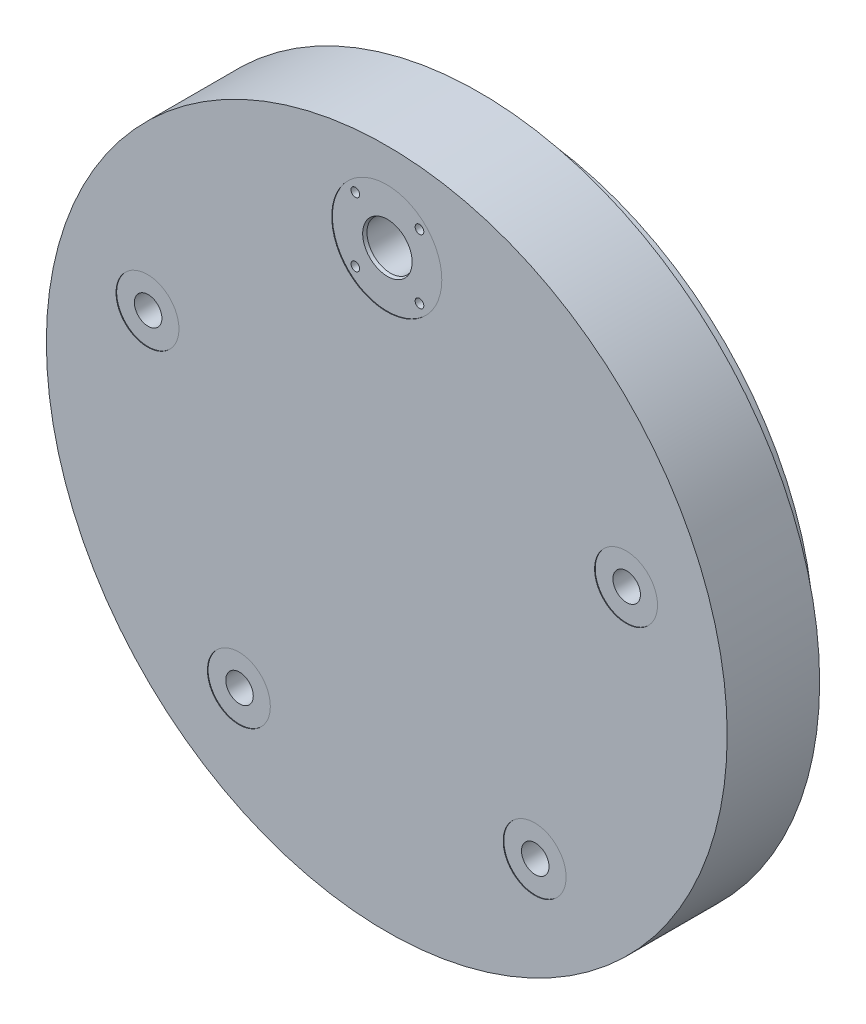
ISO-10303-21;
HEADER;
FILE_DESCRIPTION(('STEP AP214'),'2;1');
FILE_NAME('part.step','',(''),(''),'','','');
FILE_SCHEMA(('AUTOMOTIVE_DESIGN { 1 0 10303 214 1 1 1 1 }'));
ENDSEC;
DATA;
#1=APPLICATION_CONTEXT('core data for automotive mechanical design processes');
#2=APPLICATION_PROTOCOL_DEFINITION('international standard','automotive_design',2000,#1);
#3=PRODUCT_CONTEXT('',#1,'mechanical');
#4=PRODUCT('Part','Part','',(#3));
#5=PRODUCT_RELATED_PRODUCT_CATEGORY('part','',(#4));
#6=PRODUCT_DEFINITION_FORMATION('','',#4);
#7=PRODUCT_DEFINITION_CONTEXT('part definition',#1,'design');
#8=PRODUCT_DEFINITION('design','',#6,#7);
#9=PRODUCT_DEFINITION_SHAPE('','',#8);
#10=(LENGTH_UNIT() NAMED_UNIT(*) SI_UNIT(.MILLI.,.METRE.));
#11=(NAMED_UNIT(*) PLANE_ANGLE_UNIT() SI_UNIT($,.RADIAN.));
#12=(NAMED_UNIT(*) SI_UNIT($,.STERADIAN.) SOLID_ANGLE_UNIT());
#13=UNCERTAINTY_MEASURE_WITH_UNIT(LENGTH_MEASURE(1.E-05),#10,'distance_accuracy_value','');
#14=(GEOMETRIC_REPRESENTATION_CONTEXT(3) GLOBAL_UNCERTAINTY_ASSIGNED_CONTEXT((#13)) GLOBAL_UNIT_ASSIGNED_CONTEXT((#10,
#11,#12)) REPRESENTATION_CONTEXT('',''));
#15=CARTESIAN_POINT('',(0.,0.,0.));
#16=DIRECTION('',(0.,0.,1.));
#17=DIRECTION('',(1.,0.,0.));
#18=AXIS2_PLACEMENT_3D('',#15,#16,#17);
#19=CARTESIAN_POINT('',(-96.6273420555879,31.3961266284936,0.));
#20=DIRECTION('',(0.,0.,1.));
#21=DIRECTION('',(1.,0.,0.));
#22=AXIS2_PLACEMENT_3D('',#19,#20,#21);
#23=CYLINDRICAL_SURFACE('',#22,5.55624999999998);
#24=CARTESIAN_POINT('',(-96.6273420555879,31.3961266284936,-50.038));
#25=DIRECTION('',(0.,0.,1.));
#26=DIRECTION('',(1.,0.,0.));
#27=AXIS2_PLACEMENT_3D('',#24,#25,#26);
#28=CIRCLE('',#27,5.55624999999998);
#29=CARTESIAN_POINT('',(-91.0710920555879,31.3961266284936,-50.038));
#30=VERTEX_POINT('',#29);
#31=EDGE_CURVE('E101',#30,#30,#28,.T.);
#32=ORIENTED_EDGE('',*,*,#31,.F.);
#33=EDGE_LOOP('',(#32));
#34=FACE_BOUND('',#33,.T.);
#35=CARTESIAN_POINT('',(-96.6273420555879,31.3961266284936,-0.254));
#36=DIRECTION('',(0.,0.,1.));
#37=DIRECTION('',(1.,0.,0.));
#38=AXIS2_PLACEMENT_3D('',#35,#36,#37);
#39=CIRCLE('',#38,5.55624999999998);
#40=CARTESIAN_POINT('',(-91.0710920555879,31.3961266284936,-0.254));
#41=VERTEX_POINT('',#40);
#42=EDGE_CURVE('E145',#41,#41,#39,.F.);
#43=ORIENTED_EDGE('',*,*,#42,.F.);
#44=EDGE_LOOP('',(#43));
#45=FACE_BOUND('',#44,.T.);
#46=ADVANCED_FACE('F33',(#34,#45),#23,.F.);
#47=CARTESIAN_POINT('',(96.6273420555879,31.3961266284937,0.));
#48=DIRECTION('',(0.,0.,1.));
#49=DIRECTION('',(1.,0.,0.));
#50=AXIS2_PLACEMENT_3D('',#47,#48,#49);
#51=CYLINDRICAL_SURFACE('',#50,5.55624999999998);
#52=CARTESIAN_POINT('',(96.6273420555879,31.3961266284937,-50.038));
#53=DIRECTION('',(0.,0.,1.));
#54=DIRECTION('',(1.,0.,0.));
#55=AXIS2_PLACEMENT_3D('',#52,#53,#54);
#56=CIRCLE('',#55,5.55624999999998);
#57=CARTESIAN_POINT('',(102.183592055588,31.3961266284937,-50.038));
#58=VERTEX_POINT('',#57);
#59=EDGE_CURVE('E104',#58,#58,#56,.T.);
#60=ORIENTED_EDGE('',*,*,#59,.F.);
#61=EDGE_LOOP('',(#60));
#62=FACE_BOUND('',#61,.T.);
#63=CARTESIAN_POINT('',(96.6273420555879,31.3961266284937,-0.254));
#64=DIRECTION('',(0.,0.,1.));
#65=DIRECTION('',(1.,0.,0.));
#66=AXIS2_PLACEMENT_3D('',#63,#64,#65);
#67=CIRCLE('',#66,5.55624999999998);
#68=CARTESIAN_POINT('',(102.183592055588,31.3961266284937,-0.254));
#69=VERTEX_POINT('',#68);
#70=EDGE_CURVE('E140',#69,#69,#67,.F.);
#71=ORIENTED_EDGE('',*,*,#70,.F.);
#72=EDGE_LOOP('',(#71));
#73=FACE_BOUND('',#72,.T.);
#74=ADVANCED_FACE('F166',(#62,#73),#51,.F.);
#75=CARTESIAN_POINT('',(59.7189816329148,-82.196126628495,0.));
#76=DIRECTION('',(0.,0.,1.));
#77=DIRECTION('',(1.,0.,0.));
#78=AXIS2_PLACEMENT_3D('',#75,#76,#77);
#79=CYLINDRICAL_SURFACE('',#78,5.55624999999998);
#80=CARTESIAN_POINT('',(59.7189816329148,-82.196126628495,-50.038));
#81=DIRECTION('',(0.,0.,1.));
#82=DIRECTION('',(1.,0.,0.));
#83=AXIS2_PLACEMENT_3D('',#80,#81,#82);
#84=CIRCLE('',#83,5.55624999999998);
#85=CARTESIAN_POINT('',(65.2752316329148,-82.196126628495,-50.038));
#86=VERTEX_POINT('',#85);
#87=EDGE_CURVE('E110',#86,#86,#84,.T.);
#88=ORIENTED_EDGE('',*,*,#87,.F.);
#89=EDGE_LOOP('',(#88));
#90=FACE_BOUND('',#89,.T.);
#91=CARTESIAN_POINT('',(59.7189816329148,-82.196126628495,-0.254));
#92=DIRECTION('',(0.,0.,1.));
#93=DIRECTION('',(1.,0.,0.));
#94=AXIS2_PLACEMENT_3D('',#91,#92,#93);
#95=CIRCLE('',#94,5.55624999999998);
#96=CARTESIAN_POINT('',(65.2752316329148,-82.196126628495,-0.254));
#97=VERTEX_POINT('',#96);
#98=EDGE_CURVE('E135',#97,#97,#95,.F.);
#99=ORIENTED_EDGE('',*,*,#98,.F.);
#100=EDGE_LOOP('',(#99));
#101=FACE_BOUND('',#100,.T.);
#102=ADVANCED_FACE('F172',(#90,#101),#79,.F.);
#103=CARTESIAN_POINT('',(-59.7189816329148,-82.196126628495,0.));
#104=DIRECTION('',(0.,0.,1.));
#105=DIRECTION('',(1.,0.,0.));
#106=AXIS2_PLACEMENT_3D('',#103,#104,#105);
#107=CYLINDRICAL_SURFACE('',#106,5.55624999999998);
#108=CARTESIAN_POINT('',(-59.7189816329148,-82.196126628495,-50.038));
#109=DIRECTION('',(0.,0.,1.));
#110=DIRECTION('',(1.,0.,0.));
#111=AXIS2_PLACEMENT_3D('',#108,#109,#110);
#112=CIRCLE('',#111,5.55624999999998);
#113=CARTESIAN_POINT('',(-54.1627316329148,-82.196126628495,-50.038));
#114=VERTEX_POINT('',#113);
#115=EDGE_CURVE('E107',#114,#114,#112,.T.);
#116=ORIENTED_EDGE('',*,*,#115,.F.);
#117=EDGE_LOOP('',(#116));
#118=FACE_BOUND('',#117,.T.);
#119=CARTESIAN_POINT('',(-59.7189816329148,-82.196126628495,-0.254));
#120=DIRECTION('',(0.,0.,1.));
#121=DIRECTION('',(1.,0.,0.));
#122=AXIS2_PLACEMENT_3D('',#119,#120,#121);
#123=CIRCLE('',#122,5.55624999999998);
#124=CARTESIAN_POINT('',(-54.1627316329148,-82.196126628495,-0.254));
#125=VERTEX_POINT('',#124);
#126=EDGE_CURVE('E130',#125,#125,#123,.F.);
#127=ORIENTED_EDGE('',*,*,#126,.F.);
#128=EDGE_LOOP('',(#127));
#129=FACE_BOUND('',#128,.T.);
#130=ADVANCED_FACE('F181',(#118,#129),#107,.F.);
#131=CARTESIAN_POINT('',(12.954,88.646,0.));
#132=DIRECTION('',(0.,0.,1.));
#133=DIRECTION('',(1.,0.,0.));
#134=AXIS2_PLACEMENT_3D('',#131,#132,#133);
#135=CYLINDRICAL_SURFACE('',#134,1.7526);
#136=CARTESIAN_POINT('',(12.954,88.646,-7.0104));
#137=DIRECTION('',(0.,0.,1.));
#138=DIRECTION('',(1.,0.,0.));
#139=AXIS2_PLACEMENT_3D('',#136,#137,#138);
#140=CIRCLE('',#139,1.7526);
#141=CARTESIAN_POINT('',(14.7066,88.646,-7.0104));
#142=VERTEX_POINT('',#141);
#143=EDGE_CURVE('E89',#142,#142,#140,.T.);
#144=ORIENTED_EDGE('',*,*,#143,.F.);
#145=EDGE_LOOP('',(#144));
#146=FACE_BOUND('',#145,.T.);
#147=CARTESIAN_POINT('',(12.954,88.646,-0.254));
#148=DIRECTION('',(0.,0.,1.));
#149=DIRECTION('',(1.,0.,0.));
#150=AXIS2_PLACEMENT_3D('',#147,#148,#149);
#151=CIRCLE('',#150,1.7526);
#152=CARTESIAN_POINT('',(14.7066,88.646,-0.254));
#153=VERTEX_POINT('',#152);
#154=EDGE_CURVE('E240',#153,#153,#151,.F.);
#155=ORIENTED_EDGE('',*,*,#154,.F.);
#156=EDGE_LOOP('',(#155));
#157=FACE_BOUND('',#156,.T.);
#158=ADVANCED_FACE('F184',(#146,#157),#135,.F.);
#159=CARTESIAN_POINT('',(12.954,88.646,-14.478));
#160=DIRECTION('',(0.,0.,1.));
#161=DIRECTION('',(1.,0.,0.));
#162=AXIS2_PLACEMENT_3D('',#159,#160,#161);
#163=CONICAL_SURFACE('',#162,1.35255,1.02974425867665);
#164=CARTESIAN_POINT('',(12.954,88.646,-15.2906940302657));
#165=VERTEX_POINT('',#164);
#166=VERTEX_LOOP('',#165);
#167=FACE_BOUND('',#166,.T.);
#168=CARTESIAN_POINT('',(12.954,88.646,-14.478));
#169=DIRECTION('',(0.,0.,1.));
#170=DIRECTION('',(1.,0.,0.));
#171=AXIS2_PLACEMENT_3D('',#168,#169,#170);
#172=CIRCLE('',#171,1.35255);
#173=CARTESIAN_POINT('',(14.30655,88.646,-14.478));
#174=VERTEX_POINT('',#173);
#175=EDGE_CURVE('E95',#174,#174,#172,.T.);
#176=ORIENTED_EDGE('',*,*,#175,.T.);
#177=EDGE_LOOP('',(#176));
#178=FACE_BOUND('',#177,.T.);
#179=ADVANCED_FACE('F285',(#167,#178),#163,.F.);
#180=CARTESIAN_POINT('',(12.954,88.646,0.));
#181=DIRECTION('',(0.,0.,1.));
#182=DIRECTION('',(1.,0.,0.));
#183=AXIS2_PLACEMENT_3D('',#180,#181,#182);
#184=CYLINDRICAL_SURFACE('',#183,1.35255);
#185=ORIENTED_EDGE('',*,*,#175,.F.);
#186=EDGE_LOOP('',(#185));
#187=FACE_BOUND('',#186,.T.);
#188=CARTESIAN_POINT('',(12.954,88.646,-7.0104));
#189=DIRECTION('',(0.,0.,1.));
#190=DIRECTION('',(1.,0.,0.));
#191=AXIS2_PLACEMENT_3D('',#188,#189,#190);
#192=CIRCLE('',#191,1.35255);
#193=CARTESIAN_POINT('',(14.30655,88.646,-7.0104));
#194=VERTEX_POINT('',#193);
#195=EDGE_CURVE('E92',#194,#194,#192,.T.);
#196=ORIENTED_EDGE('',*,*,#195,.T.);
#197=EDGE_LOOP('',(#196));
#198=FACE_BOUND('',#197,.T.);
#199=ADVANCED_FACE('F289',(#187,#198),#184,.F.);
#200=CARTESIAN_POINT('',(14.30655,88.646,-7.0104));
#201=DIRECTION('',(0.,0.,-1.));
#202=DIRECTION('',(-1.,0.,0.));
#203=AXIS2_PLACEMENT_3D('',#200,#201,#202);
#204=PLANE('',#203);
#205=ORIENTED_EDGE('',*,*,#195,.F.);
#206=EDGE_LOOP('',(#205));
#207=FACE_BOUND('',#206,.T.);
#208=ORIENTED_EDGE('',*,*,#143,.T.);
#209=EDGE_LOOP('',(#208));
#210=FACE_BOUND('',#209,.T.);
#211=ADVANCED_FACE('F257',(#207,#210),#204,.F.);
#212=CARTESIAN_POINT('',(0.,101.6,-0.254));
#213=DIRECTION('',(0.,0.,1.));
#214=DIRECTION('',(1.,0.,0.));
#215=AXIS2_PLACEMENT_3D('',#212,#213,#214);
#216=PLANE('',#215);
#217=CARTESIAN_POINT('',(0.,101.6,-0.254));
#218=DIRECTION('',(0.,0.,1.));
#219=DIRECTION('',(1.,0.,0.));
#220=AXIS2_PLACEMENT_3D('',#217,#218,#219);
#221=CIRCLE('',#220,9.98724219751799);
#222=CARTESIAN_POINT('',(9.98724219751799,101.6,-0.254));
#223=VERTEX_POINT('',#222);
#224=EDGE_CURVE('E41',#223,#223,#221,.F.);
#225=ORIENTED_EDGE('',*,*,#224,.T.);
#226=EDGE_LOOP('',(#225));
#227=FACE_BOUND('',#226,.T.);
#228=ORIENTED_EDGE('',*,*,#154,.T.);
#229=EDGE_LOOP('',(#228));
#230=FACE_BOUND('',#229,.T.);
#231=CARTESIAN_POINT('',(12.954,114.554,-0.254));
#232=DIRECTION('',(0.,0.,1.));
#233=DIRECTION('',(1.,0.,0.));
#234=AXIS2_PLACEMENT_3D('',#231,#232,#233);
#235=CIRCLE('',#234,1.7526);
#236=CARTESIAN_POINT('',(14.7066,114.554,-0.254));
#237=VERTEX_POINT('',#236);
#238=EDGE_CURVE('E128',#237,#237,#235,.F.);
#239=ORIENTED_EDGE('',*,*,#238,.T.);
#240=EDGE_LOOP('',(#239));
#241=FACE_BOUND('',#240,.T.);
#242=CARTESIAN_POINT('',(0.,101.6,-0.254));
#243=DIRECTION('',(0.,0.,1.));
#244=DIRECTION('',(1.,0.,0.));
#245=AXIS2_PLACEMENT_3D('',#242,#243,#244);
#246=CIRCLE('',#245,22.225);
#247=CARTESIAN_POINT('',(22.225,101.6,-0.254));
#248=VERTEX_POINT('',#247);
#249=EDGE_CURVE('E129',#248,#248,#246,.T.);
#250=ORIENTED_EDGE('',*,*,#249,.T.);
#251=EDGE_LOOP('',(#250));
#252=FACE_BOUND('',#251,.T.);
#253=CARTESIAN_POINT('',(-12.954,114.554,-0.254));
#254=DIRECTION('',(0.,0.,1.));
#255=DIRECTION('',(1.,0.,0.));
#256=AXIS2_PLACEMENT_3D('',#253,#254,#255);
#257=CIRCLE('',#256,1.7526);
#258=CARTESIAN_POINT('',(-11.2014,114.554,-0.254));
#259=VERTEX_POINT('',#258);
#260=EDGE_CURVE('E125',#259,#259,#257,.F.);
#261=ORIENTED_EDGE('',*,*,#260,.T.);
#262=EDGE_LOOP('',(#261));
#263=FACE_BOUND('',#262,.T.);
#264=CARTESIAN_POINT('',(-12.954,88.646,-0.254));
#265=DIRECTION('',(0.,0.,1.));
#266=DIRECTION('',(1.,0.,0.));
#267=AXIS2_PLACEMENT_3D('',#264,#265,#266);
#268=CIRCLE('',#267,1.7526);
#269=CARTESIAN_POINT('',(-11.2014,88.646,-0.254));
#270=VERTEX_POINT('',#269);
#271=EDGE_CURVE('E237',#270,#270,#268,.F.);
#272=ORIENTED_EDGE('',*,*,#271,.T.);
#273=EDGE_LOOP('',(#272));
#274=FACE_BOUND('',#273,.T.);
#275=ADVANCED_FACE('F152',(#227,#230,#241,#252,#263,#274),#216,.T.);
#276=CARTESIAN_POINT('',(0.,101.6,-0.254));
#277=DIRECTION('',(0.,0.,1.));
#278=DIRECTION('',(1.,0.,0.));
#279=AXIS2_PLACEMENT_3D('',#276,#277,#278);
#280=CYLINDRICAL_SURFACE('',#279,22.225);
#281=ORIENTED_EDGE('',*,*,#249,.F.);
#282=EDGE_LOOP('',(#281));
#283=FACE_BOUND('',#282,.T.);
#284=CARTESIAN_POINT('',(0.,101.6,0.));
#285=DIRECTION('',(0.,0.,1.));
#286=DIRECTION('',(1.,0.,0.));
#287=AXIS2_PLACEMENT_3D('',#284,#285,#286);
#288=CIRCLE('',#287,22.225);
#289=CARTESIAN_POINT('',(22.225,101.6,0.));
#290=VERTEX_POINT('',#289);
#291=EDGE_CURVE('E133',#290,#290,#288,.T.);
#292=ORIENTED_EDGE('',*,*,#291,.T.);
#293=EDGE_LOOP('',(#292));
#294=FACE_BOUND('',#293,.T.);
#295=ADVANCED_FACE('F256',(#283,#294),#280,.F.);
#296=CARTESIAN_POINT('',(12.954,114.554,-14.478));
#297=DIRECTION('',(0.,0.,1.));
#298=DIRECTION('',(1.,0.,0.));
#299=AXIS2_PLACEMENT_3D('',#296,#297,#298);
#300=CONICAL_SURFACE('',#299,1.35255,1.02974425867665);
#301=CARTESIAN_POINT('',(12.954,114.554,-15.2906940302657));
#302=VERTEX_POINT('',#301);
#303=VERTEX_LOOP('',#302);
#304=FACE_BOUND('',#303,.T.);
#305=CARTESIAN_POINT('',(12.954,114.554,-14.478));
#306=DIRECTION('',(0.,0.,1.));
#307=DIRECTION('',(1.,0.,0.));
#308=AXIS2_PLACEMENT_3D('',#305,#306,#307);
#309=CIRCLE('',#308,1.35255);
#310=CARTESIAN_POINT('',(14.30655,114.554,-14.478));
#311=VERTEX_POINT('',#310);
#312=EDGE_CURVE('E77',#311,#311,#309,.T.);
#313=ORIENTED_EDGE('',*,*,#312,.T.);
#314=EDGE_LOOP('',(#313));
#315=FACE_BOUND('',#314,.T.);
#316=ADVANCED_FACE('F273',(#304,#315),#300,.F.);
#317=CARTESIAN_POINT('',(12.954,114.554,0.));
#318=DIRECTION('',(0.,0.,1.));
#319=DIRECTION('',(1.,0.,0.));
#320=AXIS2_PLACEMENT_3D('',#317,#318,#319);
#321=CYLINDRICAL_SURFACE('',#320,1.35255);
#322=ORIENTED_EDGE('',*,*,#312,.F.);
#323=EDGE_LOOP('',(#322));
#324=FACE_BOUND('',#323,.T.);
#325=CARTESIAN_POINT('',(12.954,114.554,-7.0104));
#326=DIRECTION('',(0.,0.,1.));
#327=DIRECTION('',(1.,0.,0.));
#328=AXIS2_PLACEMENT_3D('',#325,#326,#327);
#329=CIRCLE('',#328,1.35255);
#330=CARTESIAN_POINT('',(14.30655,114.554,-7.0104));
#331=VERTEX_POINT('',#330);
#332=EDGE_CURVE('E68',#331,#331,#329,.T.);
#333=ORIENTED_EDGE('',*,*,#332,.T.);
#334=EDGE_LOOP('',(#333));
#335=FACE_BOUND('',#334,.T.);
#336=ADVANCED_FACE('F314',(#324,#335),#321,.F.);
#337=CARTESIAN_POINT('',(14.30655,114.554,-7.0104));
#338=DIRECTION('',(0.,0.,-1.));
#339=DIRECTION('',(-1.,0.,0.));
#340=AXIS2_PLACEMENT_3D('',#337,#338,#339);
#341=PLANE('',#340);
#342=ORIENTED_EDGE('',*,*,#332,.F.);
#343=EDGE_LOOP('',(#342));
#344=FACE_BOUND('',#343,.T.);
#345=CARTESIAN_POINT('',(12.954,114.554,-7.0104));
#346=DIRECTION('',(0.,0.,1.));
#347=DIRECTION('',(1.,0.,0.));
#348=AXIS2_PLACEMENT_3D('',#345,#346,#347);
#349=CIRCLE('',#348,1.7526);
#350=CARTESIAN_POINT('',(14.7066,114.554,-7.0104));
#351=VERTEX_POINT('',#350);
#352=EDGE_CURVE('E64',#351,#351,#349,.T.);
#353=ORIENTED_EDGE('',*,*,#352,.T.);
#354=EDGE_LOOP('',(#353));
#355=FACE_BOUND('',#354,.T.);
#356=ADVANCED_FACE('F325',(#344,#355),#341,.F.);
#357=CARTESIAN_POINT('',(12.954,114.554,0.));
#358=DIRECTION('',(0.,0.,1.));
#359=DIRECTION('',(1.,0.,0.));
#360=AXIS2_PLACEMENT_3D('',#357,#358,#359);
#361=CYLINDRICAL_SURFACE('',#360,1.7526);
#362=ORIENTED_EDGE('',*,*,#352,.F.);
#363=EDGE_LOOP('',(#362));
#364=FACE_BOUND('',#363,.T.);
#365=ORIENTED_EDGE('',*,*,#238,.F.);
#366=EDGE_LOOP('',(#365));
#367=FACE_BOUND('',#366,.T.);
#368=ADVANCED_FACE('F282',(#364,#367),#361,.F.);
#369=CARTESIAN_POINT('',(-12.954,88.646,-14.478));
#370=DIRECTION('',(0.,0.,1.));
#371=DIRECTION('',(1.,0.,0.));
#372=AXIS2_PLACEMENT_3D('',#369,#370,#371);
#373=CONICAL_SURFACE('',#372,1.35255,1.02974425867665);
#374=CARTESIAN_POINT('',(-12.954,88.646,-15.2906940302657));
#375=VERTEX_POINT('',#374);
#376=VERTEX_LOOP('',#375);
#377=FACE_BOUND('',#376,.T.);
#378=CARTESIAN_POINT('',(-12.954,88.646,-14.478));
#379=DIRECTION('',(0.,0.,1.));
#380=DIRECTION('',(1.,0.,0.));
#381=AXIS2_PLACEMENT_3D('',#378,#379,#380);
#382=CIRCLE('',#381,1.35255);
#383=CARTESIAN_POINT('',(-11.60145,88.646,-14.478));
#384=VERTEX_POINT('',#383);
#385=EDGE_CURVE('E86',#384,#384,#382,.T.);
#386=ORIENTED_EDGE('',*,*,#385,.T.);
#387=EDGE_LOOP('',(#386));
#388=FACE_BOUND('',#387,.T.);
#389=ADVANCED_FACE('F278',(#377,#388),#373,.F.);
#390=CARTESIAN_POINT('',(-12.954,88.646,0.));
#391=DIRECTION('',(0.,0.,1.));
#392=DIRECTION('',(1.,0.,0.));
#393=AXIS2_PLACEMENT_3D('',#390,#391,#392);
#394=CYLINDRICAL_SURFACE('',#393,1.35255);
#395=ORIENTED_EDGE('',*,*,#385,.F.);
#396=EDGE_LOOP('',(#395));
#397=FACE_BOUND('',#396,.T.);
#398=CARTESIAN_POINT('',(-12.954,88.646,-7.0104));
#399=DIRECTION('',(0.,0.,1.));
#400=DIRECTION('',(1.,0.,0.));
#401=AXIS2_PLACEMENT_3D('',#398,#399,#400);
#402=CIRCLE('',#401,1.35255);
#403=CARTESIAN_POINT('',(-11.60145,88.646,-7.0104));
#404=VERTEX_POINT('',#403);
#405=EDGE_CURVE('E83',#404,#404,#402,.T.);
#406=ORIENTED_EDGE('',*,*,#405,.T.);
#407=EDGE_LOOP('',(#406));
#408=FACE_BOUND('',#407,.T.);
#409=ADVANCED_FACE('F268',(#397,#408),#394,.F.);
#410=CARTESIAN_POINT('',(-11.60145,88.646,-7.0104));
#411=DIRECTION('',(0.,0.,-1.));
#412=DIRECTION('',(-1.,0.,0.));
#413=AXIS2_PLACEMENT_3D('',#410,#411,#412);
#414=PLANE('',#413);
#415=ORIENTED_EDGE('',*,*,#405,.F.);
#416=EDGE_LOOP('',(#415));
#417=FACE_BOUND('',#416,.T.);
#418=CARTESIAN_POINT('',(-12.954,88.646,-7.0104));
#419=DIRECTION('',(0.,0.,1.));
#420=DIRECTION('',(1.,0.,0.));
#421=AXIS2_PLACEMENT_3D('',#418,#419,#420);
#422=CIRCLE('',#421,1.7526);
#423=CARTESIAN_POINT('',(-11.2014,88.646,-7.0104));
#424=VERTEX_POINT('',#423);
#425=EDGE_CURVE('E80',#424,#424,#422,.T.);
#426=ORIENTED_EDGE('',*,*,#425,.T.);
#427=EDGE_LOOP('',(#426));
#428=FACE_BOUND('',#427,.T.);
#429=ADVANCED_FACE('F262',(#417,#428),#414,.F.);
#430=CARTESIAN_POINT('',(-12.954,88.646,0.));
#431=DIRECTION('',(0.,0.,1.));
#432=DIRECTION('',(1.,0.,0.));
#433=AXIS2_PLACEMENT_3D('',#430,#431,#432);
#434=CYLINDRICAL_SURFACE('',#433,1.7526);
#435=ORIENTED_EDGE('',*,*,#425,.F.);
#436=EDGE_LOOP('',(#435));
#437=FACE_BOUND('',#436,.T.);
#438=ORIENTED_EDGE('',*,*,#271,.F.);
#439=EDGE_LOOP('',(#438));
#440=FACE_BOUND('',#439,.T.);
#441=ADVANCED_FACE('F198',(#437,#440),#434,.F.);
#442=CARTESIAN_POINT('',(0.,137.4775,-37.338));
#443=DIRECTION('',(0.,0.,-1.));
#444=DIRECTION('',(-1.,0.,0.));
#445=AXIS2_PLACEMENT_3D('',#442,#443,#444);
#446=PLANE('',#445);
#447=CARTESIAN_POINT('',(0.,0.,-37.338));
#448=DIRECTION('',(0.,0.,1.));
#449=DIRECTION('',(1.,0.,0.));
#450=AXIS2_PLACEMENT_3D('',#447,#448,#449);
#451=CIRCLE('',#450,122.555);
#452=CARTESIAN_POINT('',(122.555,0.,-37.338));
#453=VERTEX_POINT('',#452);
#454=EDGE_CURVE('E119',#453,#453,#451,.T.);
#455=ORIENTED_EDGE('',*,*,#454,.T.);
#456=EDGE_LOOP('',(#455));
#457=FACE_BOUND('',#456,.T.);
#458=CARTESIAN_POINT('',(0.,0.,-37.338));
#459=DIRECTION('',(0.,0.,1.));
#460=DIRECTION('',(1.,0.,0.));
#461=AXIS2_PLACEMENT_3D('',#458,#459,#460);
#462=CIRCLE('',#461,137.4775);
#463=CARTESIAN_POINT('',(137.4775,0.,-37.338));
#464=VERTEX_POINT('',#463);
#465=EDGE_CURVE('E116',#464,#464,#462,.T.);
#466=ORIENTED_EDGE('',*,*,#465,.F.);
#467=EDGE_LOOP('',(#466));
#468=FACE_BOUND('',#467,.T.);
#469=ADVANCED_FACE('F195',(#457,#468),#446,.T.);
#470=CARTESIAN_POINT('',(0.,0.,0.));
#471=DIRECTION('',(0.,0.,1.));
#472=DIRECTION('',(1.,0.,0.));
#473=AXIS2_PLACEMENT_3D('',#470,#471,#472);
#474=CYLINDRICAL_SURFACE('',#473,122.555);
#475=CARTESIAN_POINT('',(0.,0.,-50.038));
#476=DIRECTION('',(0.,0.,1.));
#477=DIRECTION('',(1.,0.,0.));
#478=AXIS2_PLACEMENT_3D('',#475,#476,#477);
#479=CIRCLE('',#478,122.555);
#480=CARTESIAN_POINT('',(122.555,0.,-50.038));
#481=VERTEX_POINT('',#480);
#482=EDGE_CURVE('E122',#481,#481,#479,.T.);
#483=ORIENTED_EDGE('',*,*,#482,.T.);
#484=EDGE_LOOP('',(#483));
#485=FACE_BOUND('',#484,.T.);
#486=ORIENTED_EDGE('',*,*,#454,.F.);
#487=EDGE_LOOP('',(#486));
#488=FACE_BOUND('',#487,.T.);
#489=ADVANCED_FACE('F193',(#485,#488),#474,.T.);
#490=CARTESIAN_POINT('',(0.,0.,0.));
#491=DIRECTION('',(0.,0.,1.));
#492=DIRECTION('',(1.,0.,0.));
#493=AXIS2_PLACEMENT_3D('',#490,#491,#492);
#494=CYLINDRICAL_SURFACE('',#493,137.4775);
#495=ORIENTED_EDGE('',*,*,#465,.T.);
#496=EDGE_LOOP('',(#495));
#497=FACE_BOUND('',#496,.T.);
#498=CARTESIAN_POINT('',(0.,0.,0.));
#499=DIRECTION('',(0.,0.,1.));
#500=DIRECTION('',(1.,0.,0.));
#501=AXIS2_PLACEMENT_3D('',#498,#499,#500);
#502=CIRCLE('',#501,137.4775);
#503=CARTESIAN_POINT('',(137.4775,0.,0.));
#504=VERTEX_POINT('',#503);
#505=EDGE_CURVE('E113',#504,#504,#502,.T.);
#506=ORIENTED_EDGE('',*,*,#505,.F.);
#507=EDGE_LOOP('',(#506));
#508=FACE_BOUND('',#507,.T.);
#509=ADVANCED_FACE('F189',(#497,#508),#494,.T.);
#510=CARTESIAN_POINT('',(0.,122.555,-50.038));
#511=DIRECTION('',(0.,0.,-1.));
#512=DIRECTION('',(-1.,0.,0.));
#513=AXIS2_PLACEMENT_3D('',#510,#511,#512);
#514=PLANE('',#513);
#515=CARTESIAN_POINT('',(0.,101.6,-50.038));
#516=DIRECTION('',(0.,0.,1.));
#517=DIRECTION('',(1.,0.,0.));
#518=AXIS2_PLACEMENT_3D('',#515,#516,#517);
#519=CIRCLE('',#518,9.52500000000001);
#520=CARTESIAN_POINT('',(9.52500000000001,101.6,-50.038));
#521=VERTEX_POINT('',#520);
#522=EDGE_CURVE('E98',#521,#521,#519,.T.);
#523=ORIENTED_EDGE('',*,*,#522,.T.);
#524=EDGE_LOOP('',(#523));
#525=FACE_BOUND('',#524,.T.);
#526=ORIENTED_EDGE('',*,*,#31,.T.);
#527=EDGE_LOOP('',(#526));
#528=FACE_BOUND('',#527,.T.);
#529=ORIENTED_EDGE('',*,*,#59,.T.);
#530=EDGE_LOOP('',(#529));
#531=FACE_BOUND('',#530,.T.);
#532=ORIENTED_EDGE('',*,*,#115,.T.);
#533=EDGE_LOOP('',(#532));
#534=FACE_BOUND('',#533,.T.);
#535=ORIENTED_EDGE('',*,*,#87,.T.);
#536=EDGE_LOOP('',(#535));
#537=FACE_BOUND('',#536,.T.);
#538=ORIENTED_EDGE('',*,*,#482,.F.);
#539=EDGE_LOOP('',(#538));
#540=FACE_BOUND('',#539,.T.);
#541=ADVANCED_FACE('F192',(#525,#528,#531,#534,#537,#540),#514,.T.);
#542=CARTESIAN_POINT('',(0.,101.6,-50.038));
#543=DIRECTION('',(0.,0.,1.));
#544=DIRECTION('',(1.,0.,0.));
#545=AXIS2_PLACEMENT_3D('',#542,#543,#544);
#546=CYLINDRICAL_SURFACE('',#545,9.52500000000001);
#547=CARTESIAN_POINT('',(0.,101.6,-1.52399999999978));
#548=DIRECTION('',(0.,0.,1.));
#549=DIRECTION('',(1.,0.,0.));
#550=AXIS2_PLACEMENT_3D('',#547,#548,#549);
#551=CIRCLE('',#550,9.52500000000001);
#552=CARTESIAN_POINT('',(9.52500000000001,101.6,-1.52399999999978));
#553=VERTEX_POINT('',#552);
#554=EDGE_CURVE('E11',#553,#553,#551,.T.);
#555=ORIENTED_EDGE('',*,*,#554,.T.);
#556=EDGE_LOOP('',(#555));
#557=FACE_BOUND('',#556,.T.);
#558=ORIENTED_EDGE('',*,*,#522,.F.);
#559=EDGE_LOOP('',(#558));
#560=FACE_BOUND('',#559,.T.);
#561=ADVANCED_FACE('F178',(#557,#560),#546,.F.);
#562=CARTESIAN_POINT('',(0.,137.4775,0.));
#563=DIRECTION('',(0.,0.,-1.));
#564=DIRECTION('',(-1.,0.,0.));
#565=AXIS2_PLACEMENT_3D('',#562,#563,#564);
#566=PLANE('',#565);
#567=CARTESIAN_POINT('',(-96.6273420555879,31.3961266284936,0.));
#568=DIRECTION('',(0.,0.,1.));
#569=DIRECTION('',(1.,0.,0.));
#570=AXIS2_PLACEMENT_3D('',#567,#568,#569);
#571=CIRCLE('',#570,12.7);
#572=CARTESIAN_POINT('',(-83.9273420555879,31.3961266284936,0.));
#573=VERTEX_POINT('',#572);
#574=EDGE_CURVE('E214',#573,#573,#571,.T.);
#575=ORIENTED_EDGE('',*,*,#574,.F.);
#576=EDGE_LOOP('',(#575));
#577=FACE_BOUND('',#576,.T.);
#578=CARTESIAN_POINT('',(96.6273420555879,31.3961266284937,0.));
#579=DIRECTION('',(0.,0.,1.));
#580=DIRECTION('',(1.,0.,0.));
#581=AXIS2_PLACEMENT_3D('',#578,#579,#580);
#582=CIRCLE('',#581,12.7);
#583=CARTESIAN_POINT('',(109.327342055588,31.3961266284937,0.));
#584=VERTEX_POINT('',#583);
#585=EDGE_CURVE('E147',#584,#584,#582,.T.);
#586=ORIENTED_EDGE('',*,*,#585,.F.);
#587=EDGE_LOOP('',(#586));
#588=FACE_BOUND('',#587,.T.);
#589=CARTESIAN_POINT('',(59.7189816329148,-82.196126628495,0.));
#590=DIRECTION('',(0.,0.,1.));
#591=DIRECTION('',(1.,0.,0.));
#592=AXIS2_PLACEMENT_3D('',#589,#590,#591);
#593=CIRCLE('',#592,12.7);
#594=CARTESIAN_POINT('',(72.4189816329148,-82.196126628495,0.));
#595=VERTEX_POINT('',#594);
#596=EDGE_CURVE('E143',#595,#595,#593,.T.);
#597=ORIENTED_EDGE('',*,*,#596,.F.);
#598=EDGE_LOOP('',(#597));
#599=FACE_BOUND('',#598,.T.);
#600=CARTESIAN_POINT('',(-59.7189816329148,-82.196126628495,0.));
#601=DIRECTION('',(0.,0.,1.));
#602=DIRECTION('',(1.,0.,0.));
#603=AXIS2_PLACEMENT_3D('',#600,#601,#602);
#604=CIRCLE('',#603,12.7);
#605=CARTESIAN_POINT('',(-47.0189816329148,-82.196126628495,0.));
#606=VERTEX_POINT('',#605);
#607=EDGE_CURVE('E138',#606,#606,#604,.T.);
#608=ORIENTED_EDGE('',*,*,#607,.F.);
#609=EDGE_LOOP('',(#608));
#610=FACE_BOUND('',#609,.T.);
#611=ORIENTED_EDGE('',*,*,#291,.F.);
#612=EDGE_LOOP('',(#611));
#613=FACE_BOUND('',#612,.T.);
#614=ORIENTED_EDGE('',*,*,#505,.T.);
#615=EDGE_LOOP('',(#614));
#616=FACE_BOUND('',#615,.T.);
#617=ADVANCED_FACE('F58',(#577,#588,#599,#610,#613,#616),#566,.F.);
#618=CARTESIAN_POINT('',(-12.954,114.554,-14.478));
#619=DIRECTION('',(0.,0.,1.));
#620=DIRECTION('',(1.,0.,0.));
#621=AXIS2_PLACEMENT_3D('',#618,#619,#620);
#622=CONICAL_SURFACE('',#621,1.35255,1.02974425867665);
#623=CARTESIAN_POINT('',(-12.954,114.554,-15.2906940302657));
#624=VERTEX_POINT('',#623);
#625=VERTEX_LOOP('',#624);
#626=FACE_BOUND('',#625,.T.);
#627=CARTESIAN_POINT('',(-12.954,114.554,-14.478));
#628=DIRECTION('',(0.,0.,1.));
#629=DIRECTION('',(1.,0.,0.));
#630=AXIS2_PLACEMENT_3D('',#627,#628,#629);
#631=CIRCLE('',#630,1.35255);
#632=CARTESIAN_POINT('',(-11.60145,114.554,-14.478));
#633=VERTEX_POINT('',#632);
#634=EDGE_CURVE('E62',#633,#633,#631,.T.);
#635=ORIENTED_EDGE('',*,*,#634,.T.);
#636=EDGE_LOOP('',(#635));
#637=FACE_BOUND('',#636,.T.);
#638=ADVANCED_FACE('F54',(#626,#637),#622,.F.);
#639=CARTESIAN_POINT('',(-12.954,114.554,0.));
#640=DIRECTION('',(0.,0.,1.));
#641=DIRECTION('',(1.,0.,0.));
#642=AXIS2_PLACEMENT_3D('',#639,#640,#641);
#643=CYLINDRICAL_SURFACE('',#642,1.35255);
#644=ORIENTED_EDGE('',*,*,#634,.F.);
#645=EDGE_LOOP('',(#644));
#646=FACE_BOUND('',#645,.T.);
#647=CARTESIAN_POINT('',(-12.954,114.554,-7.0104));
#648=DIRECTION('',(0.,0.,1.));
#649=DIRECTION('',(1.,0.,0.));
#650=AXIS2_PLACEMENT_3D('',#647,#648,#649);
#651=CIRCLE('',#650,1.35255);
#652=CARTESIAN_POINT('',(-11.60145,114.554,-7.0104));
#653=VERTEX_POINT('',#652);
#654=EDGE_CURVE('E65',#653,#653,#651,.T.);
#655=ORIENTED_EDGE('',*,*,#654,.T.);
#656=EDGE_LOOP('',(#655));
#657=FACE_BOUND('',#656,.T.);
#658=ADVANCED_FACE('F57',(#646,#657),#643,.F.);
#659=CARTESIAN_POINT('',(-11.60145,114.554,-7.0104));
#660=DIRECTION('',(0.,0.,-1.));
#661=DIRECTION('',(-1.,0.,0.));
#662=AXIS2_PLACEMENT_3D('',#659,#660,#661);
#663=PLANE('',#662);
#664=ORIENTED_EDGE('',*,*,#654,.F.);
#665=EDGE_LOOP('',(#664));
#666=FACE_BOUND('',#665,.T.);
#667=CARTESIAN_POINT('',(-12.954,114.554,-7.0104));
#668=DIRECTION('',(0.,0.,1.));
#669=DIRECTION('',(1.,0.,0.));
#670=AXIS2_PLACEMENT_3D('',#667,#668,#669);
#671=CIRCLE('',#670,1.7526);
#672=CARTESIAN_POINT('',(-11.2014,114.554,-7.0104));
#673=VERTEX_POINT('',#672);
#674=EDGE_CURVE('E71',#673,#673,#671,.T.);
#675=ORIENTED_EDGE('',*,*,#674,.T.);
#676=EDGE_LOOP('',(#675));
#677=FACE_BOUND('',#676,.T.);
#678=ADVANCED_FACE('F245',(#666,#677),#663,.F.);
#679=CARTESIAN_POINT('',(-12.954,114.554,0.));
#680=DIRECTION('',(0.,0.,1.));
#681=DIRECTION('',(1.,0.,0.));
#682=AXIS2_PLACEMENT_3D('',#679,#680,#681);
#683=CYLINDRICAL_SURFACE('',#682,1.7526);
#684=ORIENTED_EDGE('',*,*,#674,.F.);
#685=EDGE_LOOP('',(#684));
#686=FACE_BOUND('',#685,.T.);
#687=ORIENTED_EDGE('',*,*,#260,.F.);
#688=EDGE_LOOP('',(#687));
#689=FACE_BOUND('',#688,.T.);
#690=ADVANCED_FACE('F247',(#686,#689),#683,.F.);
#691=CARTESIAN_POINT('',(-59.7189816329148,-82.196126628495,-0.254));
#692=DIRECTION('',(0.,0.,1.));
#693=DIRECTION('',(1.,0.,0.));
#694=AXIS2_PLACEMENT_3D('',#691,#692,#693);
#695=PLANE('',#694);
#696=CARTESIAN_POINT('',(-59.7189816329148,-82.196126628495,-0.254));
#697=DIRECTION('',(0.,0.,1.));
#698=DIRECTION('',(1.,0.,0.));
#699=AXIS2_PLACEMENT_3D('',#696,#697,#698);
#700=CIRCLE('',#699,12.7);
#701=CARTESIAN_POINT('',(-47.0189816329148,-82.196126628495,-0.254));
#702=VERTEX_POINT('',#701);
#703=EDGE_CURVE('E134',#702,#702,#700,.T.);
#704=ORIENTED_EDGE('',*,*,#703,.T.);
#705=EDGE_LOOP('',(#704));
#706=FACE_BOUND('',#705,.T.);
#707=ORIENTED_EDGE('',*,*,#126,.T.);
#708=EDGE_LOOP('',(#707));
#709=FACE_BOUND('',#708,.T.);
#710=ADVANCED_FACE('F250',(#706,#709),#695,.T.);
#711=CARTESIAN_POINT('',(-59.7189816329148,-82.196126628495,-0.254));
#712=DIRECTION('',(0.,0.,1.));
#713=DIRECTION('',(1.,0.,0.));
#714=AXIS2_PLACEMENT_3D('',#711,#712,#713);
#715=CYLINDRICAL_SURFACE('',#714,12.7);
#716=ORIENTED_EDGE('',*,*,#703,.F.);
#717=EDGE_LOOP('',(#716));
#718=FACE_BOUND('',#717,.T.);
#719=ORIENTED_EDGE('',*,*,#607,.T.);
#720=EDGE_LOOP('',(#719));
#721=FACE_BOUND('',#720,.T.);
#722=ADVANCED_FACE('F446',(#718,#721),#715,.F.);
#723=CARTESIAN_POINT('',(59.7189816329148,-82.196126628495,-0.254));
#724=DIRECTION('',(0.,0.,1.));
#725=DIRECTION('',(1.,0.,0.));
#726=AXIS2_PLACEMENT_3D('',#723,#724,#725);
#727=PLANE('',#726);
#728=CARTESIAN_POINT('',(59.7189816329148,-82.196126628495,-0.254));
#729=DIRECTION('',(0.,0.,1.));
#730=DIRECTION('',(1.,0.,0.));
#731=AXIS2_PLACEMENT_3D('',#728,#729,#730);
#732=CIRCLE('',#731,12.7);
#733=CARTESIAN_POINT('',(72.4189816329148,-82.196126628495,-0.254));
#734=VERTEX_POINT('',#733);
#735=EDGE_CURVE('E139',#734,#734,#732,.T.);
#736=ORIENTED_EDGE('',*,*,#735,.T.);
#737=EDGE_LOOP('',(#736));
#738=FACE_BOUND('',#737,.T.);
#739=ORIENTED_EDGE('',*,*,#98,.T.);
#740=EDGE_LOOP('',(#739));
#741=FACE_BOUND('',#740,.T.);
#742=ADVANCED_FACE('F455',(#738,#741),#727,.T.);
#743=CARTESIAN_POINT('',(59.7189816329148,-82.196126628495,-0.254));
#744=DIRECTION('',(0.,0.,1.));
#745=DIRECTION('',(1.,0.,0.));
#746=AXIS2_PLACEMENT_3D('',#743,#744,#745);
#747=CYLINDRICAL_SURFACE('',#746,12.7);
#748=ORIENTED_EDGE('',*,*,#735,.F.);
#749=EDGE_LOOP('',(#748));
#750=FACE_BOUND('',#749,.T.);
#751=ORIENTED_EDGE('',*,*,#596,.T.);
#752=EDGE_LOOP('',(#751));
#753=FACE_BOUND('',#752,.T.);
#754=ADVANCED_FACE('F463',(#750,#753),#747,.F.);
#755=CARTESIAN_POINT('',(96.6273420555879,31.3961266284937,-0.254));
#756=DIRECTION('',(0.,0.,1.));
#757=DIRECTION('',(1.,0.,0.));
#758=AXIS2_PLACEMENT_3D('',#755,#756,#757);
#759=PLANE('',#758);
#760=CARTESIAN_POINT('',(96.6273420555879,31.3961266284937,-0.254));
#761=DIRECTION('',(0.,0.,1.));
#762=DIRECTION('',(1.,0.,0.));
#763=AXIS2_PLACEMENT_3D('',#760,#761,#762);
#764=CIRCLE('',#763,12.7);
#765=CARTESIAN_POINT('',(109.327342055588,31.3961266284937,-0.254));
#766=VERTEX_POINT('',#765);
#767=EDGE_CURVE('E144',#766,#766,#764,.T.);
#768=ORIENTED_EDGE('',*,*,#767,.T.);
#769=EDGE_LOOP('',(#768));
#770=FACE_BOUND('',#769,.T.);
#771=ORIENTED_EDGE('',*,*,#70,.T.);
#772=EDGE_LOOP('',(#771));
#773=FACE_BOUND('',#772,.T.);
#774=ADVANCED_FACE('F472',(#770,#773),#759,.T.);
#775=CARTESIAN_POINT('',(96.6273420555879,31.3961266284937,-0.254));
#776=DIRECTION('',(0.,0.,1.));
#777=DIRECTION('',(1.,0.,0.));
#778=AXIS2_PLACEMENT_3D('',#775,#776,#777);
#779=CYLINDRICAL_SURFACE('',#778,12.7);
#780=ORIENTED_EDGE('',*,*,#767,.F.);
#781=EDGE_LOOP('',(#780));
#782=FACE_BOUND('',#781,.T.);
#783=ORIENTED_EDGE('',*,*,#585,.T.);
#784=EDGE_LOOP('',(#783));
#785=FACE_BOUND('',#784,.T.);
#786=ADVANCED_FACE('F481',(#782,#785),#779,.F.);
#787=CARTESIAN_POINT('',(-96.6273420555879,31.3961266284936,-0.254));
#788=DIRECTION('',(0.,0.,1.));
#789=DIRECTION('',(1.,0.,0.));
#790=AXIS2_PLACEMENT_3D('',#787,#788,#789);
#791=PLANE('',#790);
#792=CARTESIAN_POINT('',(-96.6273420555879,31.3961266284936,-0.254));
#793=DIRECTION('',(0.,0.,1.));
#794=DIRECTION('',(1.,0.,0.));
#795=AXIS2_PLACEMENT_3D('',#792,#793,#794);
#796=CIRCLE('',#795,12.7);
#797=CARTESIAN_POINT('',(-83.9273420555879,31.3961266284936,-0.254));
#798=VERTEX_POINT('',#797);
#799=EDGE_CURVE('E148',#798,#798,#796,.T.);
#800=ORIENTED_EDGE('',*,*,#799,.T.);
#801=EDGE_LOOP('',(#800));
#802=FACE_BOUND('',#801,.T.);
#803=ORIENTED_EDGE('',*,*,#42,.T.);
#804=EDGE_LOOP('',(#803));
#805=FACE_BOUND('',#804,.T.);
#806=ADVANCED_FACE('F161',(#802,#805),#791,.T.);
#807=CARTESIAN_POINT('',(-96.6273420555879,31.3961266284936,-0.254));
#808=DIRECTION('',(0.,0.,1.));
#809=DIRECTION('',(1.,0.,0.));
#810=AXIS2_PLACEMENT_3D('',#807,#808,#809);
#811=CYLINDRICAL_SURFACE('',#810,12.7);
#812=ORIENTED_EDGE('',*,*,#799,.F.);
#813=EDGE_LOOP('',(#812));
#814=FACE_BOUND('',#813,.T.);
#815=ORIENTED_EDGE('',*,*,#574,.T.);
#816=EDGE_LOOP('',(#815));
#817=FACE_BOUND('',#816,.T.);
#818=ADVANCED_FACE('F156',(#814,#817),#811,.F.);
#819=CARTESIAN_POINT('',(0.,101.6,-0.253999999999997));
#820=DIRECTION('',(0.,0.,1.));
#821=DIRECTION('',(1.,0.,0.));
#822=AXIS2_PLACEMENT_3D('',#819,#820,#821);
#823=CONICAL_SURFACE('',#822,9.987242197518,0.34906585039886);
#824=ORIENTED_EDGE('',*,*,#554,.F.);
#825=EDGE_LOOP('',(#824));
#826=FACE_BOUND('',#825,.T.);
#827=ORIENTED_EDGE('',*,*,#224,.F.);
#828=EDGE_LOOP('',(#827));
#829=FACE_BOUND('',#828,.T.);
#830=ADVANCED_FACE('F35',(#826,#829),#823,.F.);
#831=CLOSED_SHELL('',(#46,#74,#102,#130,#158,#179,#199,#211,#275,#295,#316,#336,#356,#368,#389,
#409,#429,#441,#469,#489,#509,#541,#561,#617,#638,#658,#678,#690,#710,#722,#742,#754,#774,#786,
#806,#818,#830));
#832=MANIFOLD_SOLID_BREP('B2',#831);
#833=ADVANCED_BREP_SHAPE_REPRESENTATION('',(#18,#832),#14);
#834=SHAPE_DEFINITION_REPRESENTATION(#9,#833);
ENDSEC;
END-ISO-10303-21;
